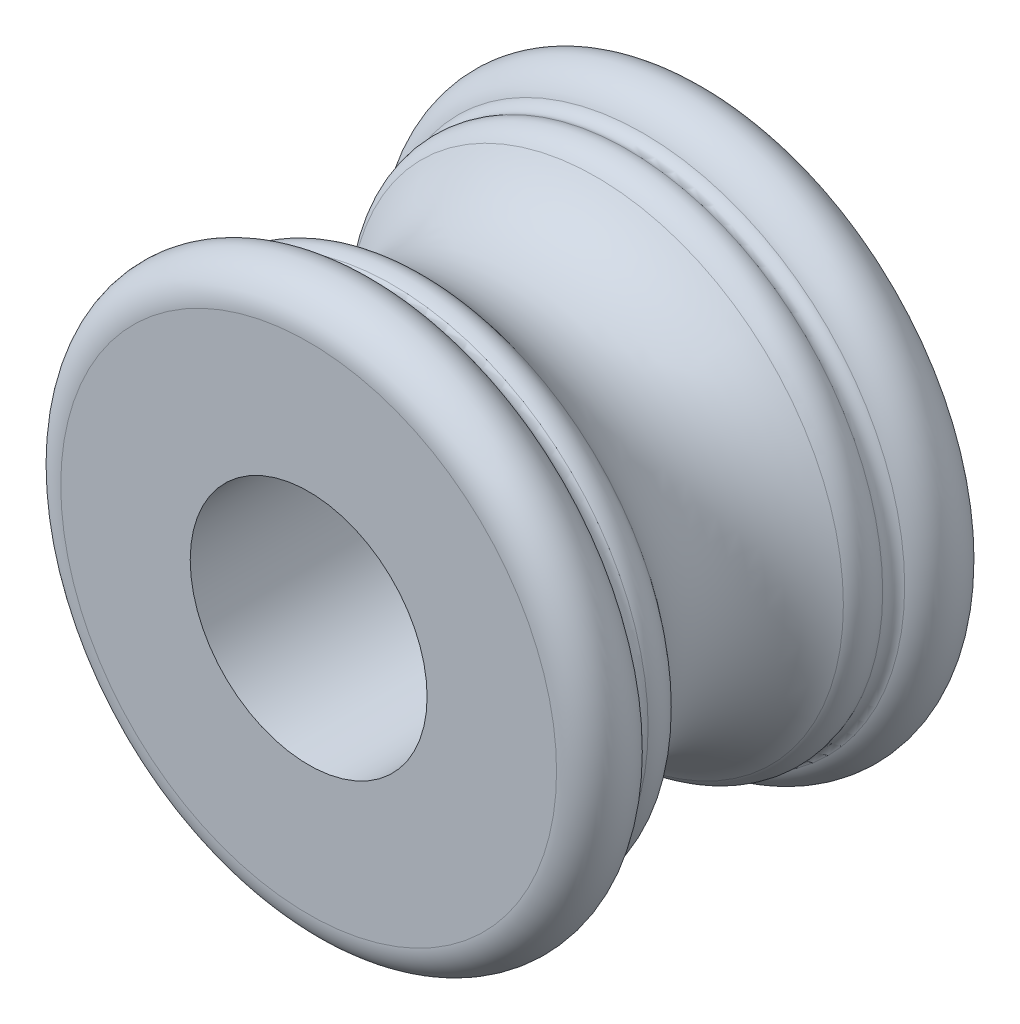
from build123d import *


with BuildPart() as part:
    # Sketch 1 → Revolve 1 (revolve)
    with BuildSketch(Plane(origin=(0, 0, 0), x_dir=(0, 0, -1), z_dir=(1, 0, 0)), mode=Mode.PRIVATE) as revolve_1_sk:
        with BuildLine():
            Line((0, 10.465), (0, 5))
            Line((0, 5), (17, 5))
            Line((17, 5), (17, 10.465))
            ThreePointArc((17, 10.465), (15.795652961, 11.935574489), (14.116547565, 11.04470627))
            ThreePointArc((14.116547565, 11.04470627), (13.839297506, 10.772989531), (13.451193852, 10.781541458))
            ThreePointArc((13.451193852, 10.781541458), (12.73443124, 10.838857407), (12.141797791, 10.431648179))
            ThreePointArc((12.141797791, 10.431648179), (8.5, 8.575), (4.858202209, 10.431648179))
            ThreePointArc((4.858202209, 10.431648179), (4.26556876, 10.838857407), (3.548806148, 10.781541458))
            ThreePointArc((3.548806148, 10.781541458), (3.160702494, 10.772989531), (2.883452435, 11.04470627))
            ThreePointArc((2.883452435, 11.04470627), (1.204347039, 11.935574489), (0, 10.465))
        make_face()
    revolve(revolve_1_sk.sketch.rotate(Axis((0, 0, 7.079171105), (0, 0, -1)), 90), axis=Axis((0, 0, 7.079171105), (0, 0, -1)))


solid = part.part
